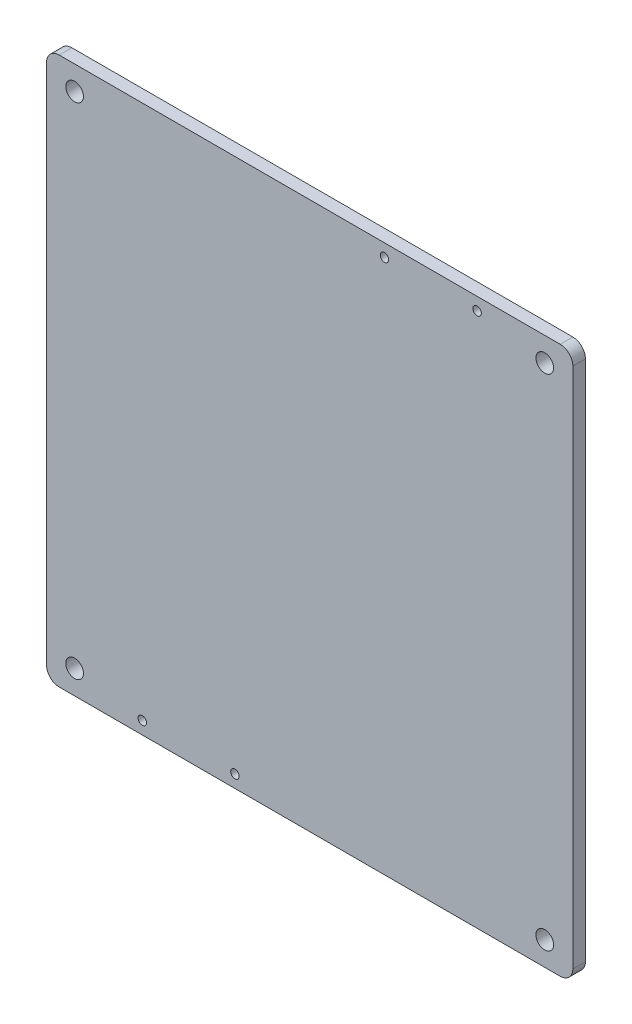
from build123d import *

# Parameters (mm, degrees)
SKETCH1_W           = 125
SKETCH1_H           = 130
BOSS_EXTRUDE1_DEPTH = 3
FILLET1_R           = 3
SKETCH2_R           = 2.1
CUT_EXTRUDE1_DEPTH  = 3
SKETCH3_R           = 1
CUT_EXTRUDE2_DEPTH  = 3


with BuildPart() as part:
    # Sketch1 → Boss-Extrude1 (new body)
    with BuildSketch(Plane.XY):
        Rectangle(SKETCH1_W, SKETCH1_H)
    extrude(amount=BOSS_EXTRUDE1_DEPTH)

    # Fillet1
    fillet1_edges = [part.edges().sort_by_distance(p)[0] for p in [
        (62.5, -65, 1.5),
        (-62.5, -65, 1.5),
        (-62.5, 65, 1.5),
        (62.5, 65, 1.5),
    ]]
    fillet(fillet1_edges, radius=FILLET1_R)

    # Sketch2 → Cut-Extrude1 (cut)
    with BuildSketch(Plane(origin=(0, 0, 0), x_dir=(-1, 0, 0), z_dir=(0, 0, -1))):
        with Locations((-55.835, 59.325)):
            Circle(SKETCH2_R)
        with Locations((55.835, 59.325)):
            Circle(SKETCH2_R)
        with Locations((-55.835, -59.325)):
            Circle(SKETCH2_R)
        with Locations((55.835, -59.325)):
            Circle(SKETCH2_R)
    extrude(amount=-CUT_EXTRUDE1_DEPTH, mode=Mode.SUBTRACT)

    # Sketch3 → Cut-Extrude2 (cut)
    with BuildSketch(Plane(origin=(0, 0, 0), x_dir=(-1, 0, 0), z_dir=(0, 0, -1))):
        with Locations((-39.76, 62)):
            Circle(SKETCH3_R)
        with Locations((-17.76, 62)):
            Circle(SKETCH3_R)
        with Locations((39.76, -62)):
            Circle(SKETCH3_R)
        with Locations((17.76, -62)):
            Circle(SKETCH3_R)
    extrude(amount=-CUT_EXTRUDE2_DEPTH, mode=Mode.SUBTRACT)


solid = part.part
